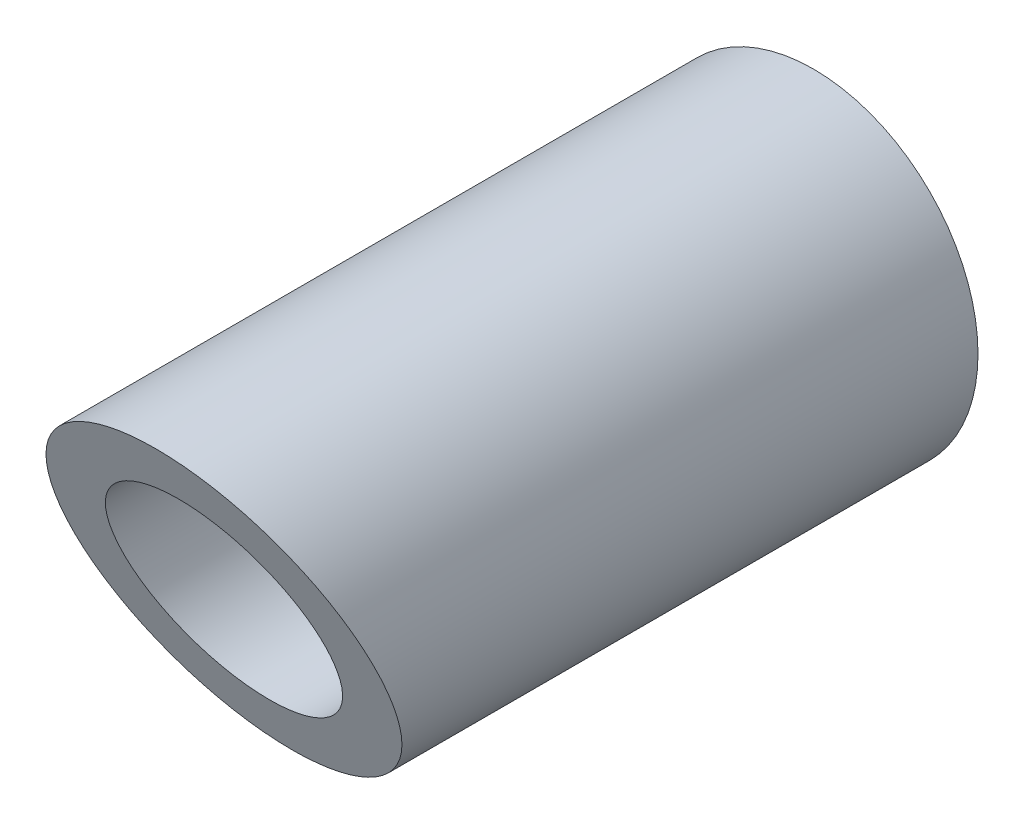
ISO-10303-21;
HEADER;
FILE_DESCRIPTION(('STEP AP214'),'2;1');
FILE_NAME('part.step','',(''),(''),'','','');
FILE_SCHEMA(('AUTOMOTIVE_DESIGN { 1 0 10303 214 1 1 1 1 }'));
ENDSEC;
DATA;
#1=APPLICATION_CONTEXT('core data for automotive mechanical design processes');
#2=APPLICATION_PROTOCOL_DEFINITION('international standard','automotive_design',2000,#1);
#3=PRODUCT_CONTEXT('',#1,'mechanical');
#4=PRODUCT('Part','Part','',(#3));
#5=PRODUCT_RELATED_PRODUCT_CATEGORY('part','',(#4));
#6=PRODUCT_DEFINITION_FORMATION('','',#4);
#7=PRODUCT_DEFINITION_CONTEXT('part definition',#1,'design');
#8=PRODUCT_DEFINITION('design','',#6,#7);
#9=PRODUCT_DEFINITION_SHAPE('','',#8);
#10=(LENGTH_UNIT() NAMED_UNIT(*) SI_UNIT(.MILLI.,.METRE.));
#11=(NAMED_UNIT(*) PLANE_ANGLE_UNIT() SI_UNIT($,.RADIAN.));
#12=(NAMED_UNIT(*) SI_UNIT($,.STERADIAN.) SOLID_ANGLE_UNIT());
#13=UNCERTAINTY_MEASURE_WITH_UNIT(LENGTH_MEASURE(1.E-05),#10,'distance_accuracy_value','');
#14=(GEOMETRIC_REPRESENTATION_CONTEXT(3) GLOBAL_UNCERTAINTY_ASSIGNED_CONTEXT((#13)) GLOBAL_UNIT_ASSIGNED_CONTEXT((#10,
#11,#12)) REPRESENTATION_CONTEXT('',''));
#15=CARTESIAN_POINT('',(0.,0.,0.));
#16=DIRECTION('',(0.,0.,1.));
#17=DIRECTION('',(1.,0.,0.));
#18=AXIS2_PLACEMENT_3D('',#15,#16,#17);
#19=CARTESIAN_POINT('',(0.,0.,0.));
#20=DIRECTION('',(0.,0.,1.));
#21=DIRECTION('',(1.,0.,0.));
#22=AXIS2_PLACEMENT_3D('',#19,#20,#21);
#23=PLANE('',#22);
#24=CARTESIAN_POINT('',(0.,0.,0.));
#25=DIRECTION('',(0.,0.,1.));
#26=DIRECTION('',(1.,0.,0.));
#27=AXIS2_PLACEMENT_3D('',#24,#25,#26);
#28=CIRCLE('',#27,7.5);
#29=CARTESIAN_POINT('',(7.5,0.,0.));
#30=VERTEX_POINT('',#29);
#31=EDGE_CURVE('E38',#30,#30,#28,.T.);
#32=ORIENTED_EDGE('',*,*,#31,.F.);
#33=EDGE_LOOP('',(#32));
#34=FACE_BOUND('',#33,.T.);
#35=CARTESIAN_POINT('',(0.,0.,0.));
#36=DIRECTION('',(0.,0.,1.));
#37=DIRECTION('',(1.,0.,0.));
#38=AXIS2_PLACEMENT_3D('',#35,#36,#37);
#39=CIRCLE('',#38,5.);
#40=CARTESIAN_POINT('',(5.,0.,0.));
#41=VERTEX_POINT('',#40);
#42=EDGE_CURVE('E42',#41,#41,#39,.T.);
#43=ORIENTED_EDGE('',*,*,#42,.T.);
#44=EDGE_LOOP('',(#43));
#45=FACE_BOUND('',#44,.T.);
#46=ADVANCED_FACE('F31',(#34,#45),#23,.F.);
#47=CARTESIAN_POINT('',(0.,0.,30.));
#48=DIRECTION('',(0.,0.,-1.));
#49=DIRECTION('',(-1.,0.,0.));
#50=AXIS2_PLACEMENT_3D('',#47,#48,#49);
#51=CYLINDRICAL_SURFACE('',#50,7.5);
#52=CARTESIAN_POINT('',(0.,0.,26.8933982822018));
#53=DIRECTION('',(0.,0.38268343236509,-0.923879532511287));
#54=DIRECTION('',(0.,-0.923879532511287,-0.38268343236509));
#55=AXIS2_PLACEMENT_3D('',#52,#53,#54);
#56=ELLIPSE('',#55,8.11794150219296,7.5);
#57=CARTESIAN_POINT('',(0.,-7.5,23.7867965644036));
#58=VERTEX_POINT('',#57);
#59=EDGE_CURVE('E46',#58,#58,#56,.T.);
#60=ORIENTED_EDGE('',*,*,#59,.T.);
#61=EDGE_LOOP('',(#60));
#62=FACE_BOUND('',#61,.T.);
#63=ORIENTED_EDGE('',*,*,#31,.T.);
#64=EDGE_LOOP('',(#63));
#65=FACE_BOUND('',#64,.T.);
#66=ADVANCED_FACE('F33',(#62,#65),#51,.T.);
#67=CARTESIAN_POINT('',(0.,0.,30.));
#68=DIRECTION('',(0.,0.,-1.));
#69=DIRECTION('',(-1.,0.,0.));
#70=AXIS2_PLACEMENT_3D('',#67,#68,#69);
#71=CYLINDRICAL_SURFACE('',#70,5.);
#72=CARTESIAN_POINT('',(0.,0.,26.8933982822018));
#73=DIRECTION('',(0.,0.38268343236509,-0.923879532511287));
#74=DIRECTION('',(0.,-0.923879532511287,-0.38268343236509));
#75=AXIS2_PLACEMENT_3D('',#72,#73,#74);
#76=ELLIPSE('',#75,5.41196100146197,5.);
#77=CARTESIAN_POINT('',(0.,-5.,24.8223304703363));
#78=VERTEX_POINT('',#77);
#79=EDGE_CURVE('E10',#78,#78,#76,.T.);
#80=ORIENTED_EDGE('',*,*,#79,.F.);
#81=EDGE_LOOP('',(#80));
#82=FACE_BOUND('',#81,.T.);
#83=ORIENTED_EDGE('',*,*,#42,.F.);
#84=EDGE_LOOP('',(#83));
#85=FACE_BOUND('',#84,.T.);
#86=ADVANCED_FACE('F55',(#82,#85),#71,.F.);
#87=CARTESIAN_POINT('',(55.3029326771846,7.5,30.));
#88=DIRECTION('',(0.,0.38268343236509,-0.923879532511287));
#89=DIRECTION('',(0.,0.923879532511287,0.38268343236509));
#90=AXIS2_PLACEMENT_3D('',#87,#88,#89);
#91=PLANE('',#90);
#92=ORIENTED_EDGE('',*,*,#79,.T.);
#93=EDGE_LOOP('',(#92));
#94=FACE_BOUND('',#93,.T.);
#95=ORIENTED_EDGE('',*,*,#59,.F.);
#96=EDGE_LOOP('',(#95));
#97=FACE_BOUND('',#96,.T.);
#98=ADVANCED_FACE('F53',(#94,#97),#91,.F.);
#99=CLOSED_SHELL('',(#46,#66,#86,#98));
#100=MANIFOLD_SOLID_BREP('B2',#99);
#101=ADVANCED_BREP_SHAPE_REPRESENTATION('',(#18,#100),#14);
#102=SHAPE_DEFINITION_REPRESENTATION(#9,#101);
ENDSEC;
END-ISO-10303-21;
